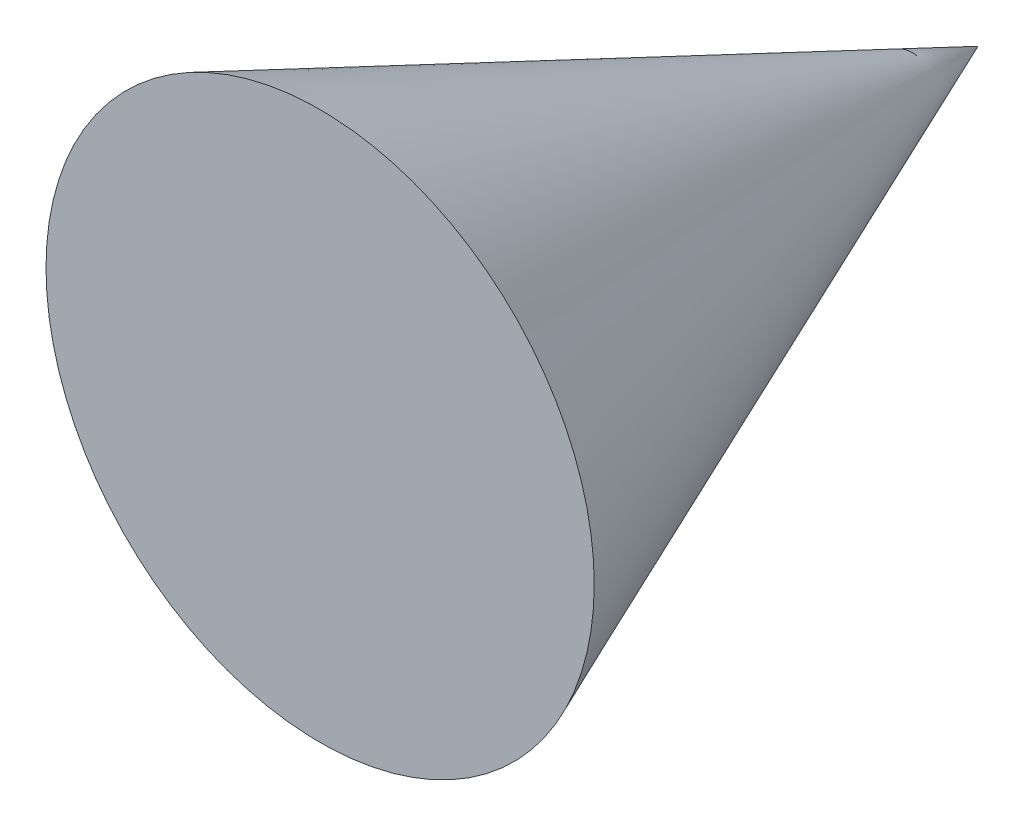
ISO-10303-21;
HEADER;
FILE_DESCRIPTION(('STEP AP214'),'2;1');
FILE_NAME('part.step','',(''),(''),'','','');
FILE_SCHEMA(('AUTOMOTIVE_DESIGN { 1 0 10303 214 1 1 1 1 }'));
ENDSEC;
DATA;
#1=APPLICATION_CONTEXT('core data for automotive mechanical design processes');
#2=APPLICATION_PROTOCOL_DEFINITION('international standard','automotive_design',2000,#1);
#3=PRODUCT_CONTEXT('',#1,'mechanical');
#4=PRODUCT('Part','Part','',(#3));
#5=PRODUCT_RELATED_PRODUCT_CATEGORY('part','',(#4));
#6=PRODUCT_DEFINITION_FORMATION('','',#4);
#7=PRODUCT_DEFINITION_CONTEXT('part definition',#1,'design');
#8=PRODUCT_DEFINITION('design','',#6,#7);
#9=PRODUCT_DEFINITION_SHAPE('','',#8);
#10=(LENGTH_UNIT() NAMED_UNIT(*) SI_UNIT(.MILLI.,.METRE.));
#11=(NAMED_UNIT(*) PLANE_ANGLE_UNIT() SI_UNIT($,.RADIAN.));
#12=(NAMED_UNIT(*) SI_UNIT($,.STERADIAN.) SOLID_ANGLE_UNIT());
#13=UNCERTAINTY_MEASURE_WITH_UNIT(LENGTH_MEASURE(1.E-05),#10,'distance_accuracy_value','');
#14=(GEOMETRIC_REPRESENTATION_CONTEXT(3) GLOBAL_UNCERTAINTY_ASSIGNED_CONTEXT((#13)) GLOBAL_UNIT_ASSIGNED_CONTEXT((#10,
#11,#12)) REPRESENTATION_CONTEXT('',''));
#15=CARTESIAN_POINT('',(0.,0.,0.));
#16=DIRECTION('',(0.,0.,1.));
#17=DIRECTION('',(1.,0.,0.));
#18=AXIS2_PLACEMENT_3D('',#15,#16,#17);
#19=CARTESIAN_POINT('',(0.,0.,-25.6352941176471));
#20=DIRECTION('',(0.,0.,1.));
#21=DIRECTION('',(1.,0.,0.));
#22=AXIS2_PLACEMENT_3D('',#19,#20,#21);
#23=CONICAL_SURFACE('',#22,0.,0.394791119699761);
#24=CARTESIAN_POINT('',(0.,0.,34.3647058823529));
#25=DIRECTION('',(0.,0.,-1.));
#26=DIRECTION('',(-1.,0.,0.));
#27=AXIS2_PLACEMENT_3D('',#24,#25,#26);
#28=CIRCLE('',#27,25.);
#29=CARTESIAN_POINT('',(-25.,0.,34.3647058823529));
#30=VERTEX_POINT('',#29);
#31=EDGE_CURVE('E11',#30,#30,#28,.T.);
#32=ORIENTED_EDGE('',*,*,#31,.T.);
#33=EDGE_LOOP('',(#32));
#34=FACE_BOUND('',#33,.T.);
#35=CARTESIAN_POINT('',(0.,0.,-25.6352941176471));
#36=VERTEX_POINT('',#35);
#37=VERTEX_LOOP('',#36);
#38=FACE_BOUND('',#37,.T.);
#39=ADVANCED_FACE('F31',(#34,#38),#23,.T.);
#40=CARTESIAN_POINT('',(-25.,0.,34.3647058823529));
#41=DIRECTION('',(0.,0.,1.));
#42=DIRECTION('',(1.,0.,0.));
#43=AXIS2_PLACEMENT_3D('',#40,#41,#42);
#44=PLANE('',#43);
#45=ORIENTED_EDGE('',*,*,#31,.F.);
#46=EDGE_LOOP('',(#45));
#47=FACE_BOUND('',#46,.T.);
#48=ADVANCED_FACE('F39',(#47),#44,.T.);
#49=CLOSED_SHELL('',(#39,#48));
#50=MANIFOLD_SOLID_BREP('B2',#49);
#51=ADVANCED_BREP_SHAPE_REPRESENTATION('',(#18,#50),#14);
#52=SHAPE_DEFINITION_REPRESENTATION(#9,#51);
ENDSEC;
END-ISO-10303-21;
